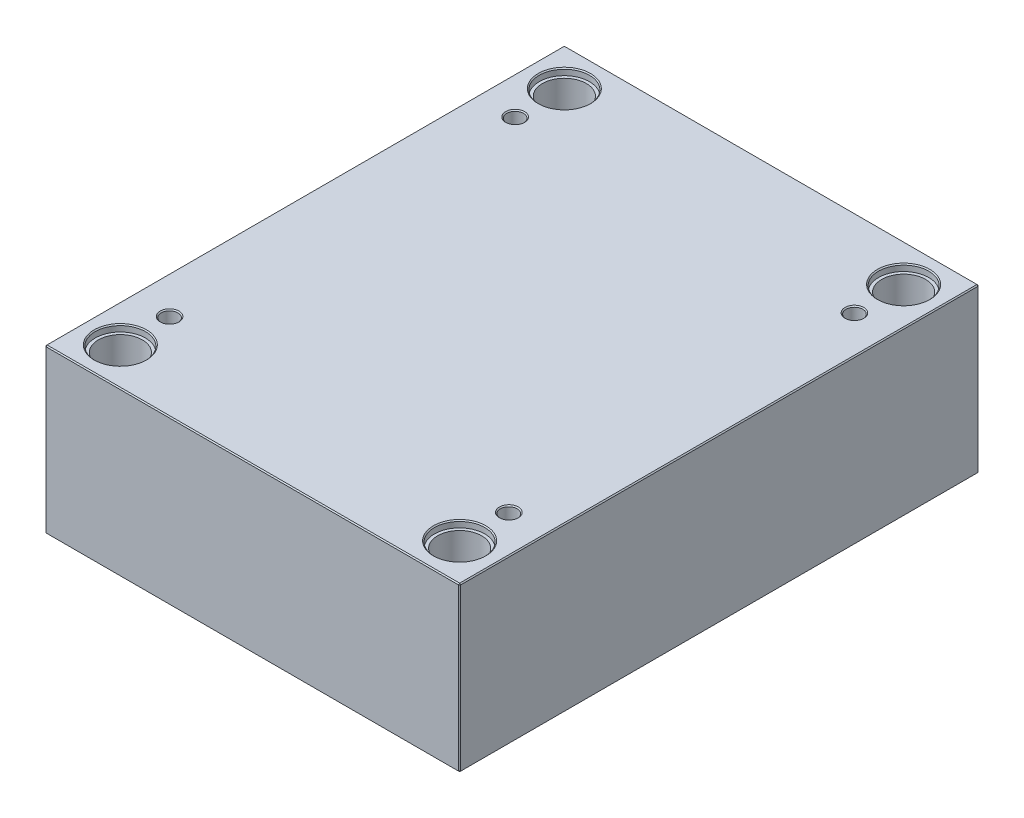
ISO-10303-21;
HEADER;
FILE_DESCRIPTION(('STEP AP214'),'2;1');
FILE_NAME('part.step','',(''),(''),'','','');
FILE_SCHEMA(('AUTOMOTIVE_DESIGN { 1 0 10303 214 1 1 1 1 }'));
ENDSEC;
DATA;
#1=APPLICATION_CONTEXT('core data for automotive mechanical design processes');
#2=APPLICATION_PROTOCOL_DEFINITION('international standard','automotive_design',2000,#1);
#3=PRODUCT_CONTEXT('',#1,'mechanical');
#4=PRODUCT('Part','Part','',(#3));
#5=PRODUCT_RELATED_PRODUCT_CATEGORY('part','',(#4));
#6=PRODUCT_DEFINITION_FORMATION('','',#4);
#7=PRODUCT_DEFINITION_CONTEXT('part definition',#1,'design');
#8=PRODUCT_DEFINITION('design','',#6,#7);
#9=PRODUCT_DEFINITION_SHAPE('','',#8);
#10=(LENGTH_UNIT() NAMED_UNIT(*) SI_UNIT(.MILLI.,.METRE.));
#11=(NAMED_UNIT(*) PLANE_ANGLE_UNIT() SI_UNIT($,.RADIAN.));
#12=(NAMED_UNIT(*) SI_UNIT($,.STERADIAN.) SOLID_ANGLE_UNIT());
#13=UNCERTAINTY_MEASURE_WITH_UNIT(LENGTH_MEASURE(1.E-05),#10,'distance_accuracy_value','');
#14=(GEOMETRIC_REPRESENTATION_CONTEXT(3) GLOBAL_UNCERTAINTY_ASSIGNED_CONTEXT((#13)) GLOBAL_UNIT_ASSIGNED_CONTEXT((#10,
#11,#12)) REPRESENTATION_CONTEXT('',''));
#15=CARTESIAN_POINT('',(0.,0.,0.));
#16=DIRECTION('',(0.,0.,1.));
#17=DIRECTION('',(1.,0.,0.));
#18=AXIS2_PLACEMENT_3D('',#15,#16,#17);
#19=CARTESIAN_POINT('',(-162.,0.,-212.));
#20=DIRECTION('',(0.,1.,0.));
#21=DIRECTION('',(0.,0.,1.));
#22=AXIS2_PLACEMENT_3D('',#19,#20,#21);
#23=CYLINDRICAL_SURFACE('',#22,21.);
#24=CARTESIAN_POINT('',(-162.,1.00000000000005,-212.));
#25=DIRECTION('',(0.,1.,0.));
#26=DIRECTION('',(0.,0.,1.));
#27=AXIS2_PLACEMENT_3D('',#24,#25,#26);
#28=CIRCLE('',#27,21.);
#29=CARTESIAN_POINT('',(-162.,1.00000000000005,-191.));
#30=VERTEX_POINT('',#29);
#31=EDGE_CURVE('E472',#30,#30,#28,.F.);
#32=ORIENTED_EDGE('',*,*,#31,.T.);
#33=EDGE_LOOP('',(#32));
#34=FACE_BOUND('',#33,.T.);
#35=CARTESIAN_POINT('',(-162.,149.7,-212.));
#36=DIRECTION('',(0.,1.,0.));
#37=DIRECTION('',(0.,0.,1.));
#38=AXIS2_PLACEMENT_3D('',#35,#36,#37);
#39=CIRCLE('',#38,21.);
#40=CARTESIAN_POINT('',(-162.,149.7,-191.));
#41=VERTEX_POINT('',#40);
#42=EDGE_CURVE('E221',#41,#41,#39,.F.);
#43=ORIENTED_EDGE('',*,*,#42,.F.);
#44=EDGE_LOOP('',(#43));
#45=FACE_BOUND('',#44,.T.);
#46=ADVANCED_FACE('F16',(#34,#45),#23,.F.);
#47=CARTESIAN_POINT('',(162.,0.,-212.));
#48=DIRECTION('',(0.,1.,0.));
#49=DIRECTION('',(0.,0.,1.));
#50=AXIS2_PLACEMENT_3D('',#47,#48,#49);
#51=CYLINDRICAL_SURFACE('',#50,21.);
#52=CARTESIAN_POINT('',(162.,1.00000000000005,-212.));
#53=DIRECTION('',(0.,1.,0.));
#54=DIRECTION('',(0.,0.,1.));
#55=AXIS2_PLACEMENT_3D('',#52,#53,#54);
#56=CIRCLE('',#55,21.);
#57=CARTESIAN_POINT('',(162.,1.00000000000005,-191.));
#58=VERTEX_POINT('',#57);
#59=EDGE_CURVE('E474',#58,#58,#56,.F.);
#60=ORIENTED_EDGE('',*,*,#59,.T.);
#61=EDGE_LOOP('',(#60));
#62=FACE_BOUND('',#61,.T.);
#63=CARTESIAN_POINT('',(162.,149.7,-212.));
#64=DIRECTION('',(0.,1.,0.));
#65=DIRECTION('',(0.,0.,1.));
#66=AXIS2_PLACEMENT_3D('',#63,#64,#65);
#67=CIRCLE('',#66,21.);
#68=CARTESIAN_POINT('',(162.,149.7,-191.));
#69=VERTEX_POINT('',#68);
#70=EDGE_CURVE('E218',#69,#69,#67,.F.);
#71=ORIENTED_EDGE('',*,*,#70,.F.);
#72=EDGE_LOOP('',(#71));
#73=FACE_BOUND('',#72,.T.);
#74=ADVANCED_FACE('F263',(#62,#73),#51,.F.);
#75=CARTESIAN_POINT('',(162.,0.,212.));
#76=DIRECTION('',(0.,1.,0.));
#77=DIRECTION('',(0.,0.,1.));
#78=AXIS2_PLACEMENT_3D('',#75,#76,#77);
#79=CYLINDRICAL_SURFACE('',#78,21.);
#80=CARTESIAN_POINT('',(162.,1.00000000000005,212.));
#81=DIRECTION('',(0.,1.,0.));
#82=DIRECTION('',(0.,0.,1.));
#83=AXIS2_PLACEMENT_3D('',#80,#81,#82);
#84=CIRCLE('',#83,21.);
#85=CARTESIAN_POINT('',(162.,1.00000000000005,233.));
#86=VERTEX_POINT('',#85);
#87=EDGE_CURVE('E477',#86,#86,#84,.F.);
#88=ORIENTED_EDGE('',*,*,#87,.T.);
#89=EDGE_LOOP('',(#88));
#90=FACE_BOUND('',#89,.T.);
#91=CARTESIAN_POINT('',(162.,149.7,212.));
#92=DIRECTION('',(0.,1.,0.));
#93=DIRECTION('',(0.,0.,1.));
#94=AXIS2_PLACEMENT_3D('',#91,#92,#93);
#95=CIRCLE('',#94,21.);
#96=CARTESIAN_POINT('',(162.,149.7,233.));
#97=VERTEX_POINT('',#96);
#98=EDGE_CURVE('E214',#97,#97,#95,.F.);
#99=ORIENTED_EDGE('',*,*,#98,.F.);
#100=EDGE_LOOP('',(#99));
#101=FACE_BOUND('',#100,.T.);
#102=ADVANCED_FACE('F270',(#90,#101),#79,.F.);
#103=CARTESIAN_POINT('',(-162.,0.,212.));
#104=DIRECTION('',(0.,1.,0.));
#105=DIRECTION('',(0.,0.,1.));
#106=AXIS2_PLACEMENT_3D('',#103,#104,#105);
#107=CYLINDRICAL_SURFACE('',#106,21.);
#108=CARTESIAN_POINT('',(-162.,1.00000000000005,212.));
#109=DIRECTION('',(0.,1.,0.));
#110=DIRECTION('',(0.,0.,1.));
#111=AXIS2_PLACEMENT_3D('',#108,#109,#110);
#112=CIRCLE('',#111,21.);
#113=CARTESIAN_POINT('',(-162.,1.00000000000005,233.));
#114=VERTEX_POINT('',#113);
#115=EDGE_CURVE('E480',#114,#114,#112,.F.);
#116=ORIENTED_EDGE('',*,*,#115,.T.);
#117=EDGE_LOOP('',(#116));
#118=FACE_BOUND('',#117,.T.);
#119=CARTESIAN_POINT('',(-162.,149.7,212.));
#120=DIRECTION('',(0.,1.,0.));
#121=DIRECTION('',(0.,0.,1.));
#122=AXIS2_PLACEMENT_3D('',#119,#120,#121);
#123=CIRCLE('',#122,21.);
#124=CARTESIAN_POINT('',(-162.,149.7,233.));
#125=VERTEX_POINT('',#124);
#126=EDGE_CURVE('E211',#125,#125,#123,.F.);
#127=ORIENTED_EDGE('',*,*,#126,.F.);
#128=EDGE_LOOP('',(#127));
#129=FACE_BOUND('',#128,.T.);
#130=ADVANCED_FACE('F277',(#118,#129),#107,.F.);
#131=CARTESIAN_POINT('',(-198.,156.,248.));
#132=DIRECTION('',(1.,0.,0.));
#133=DIRECTION('',(0.,0.,-1.));
#134=AXIS2_PLACEMENT_3D('',#131,#132,#133);
#135=PLANE('',#134);
#136=DIRECTION('',(0.,-1.,0.));
#137=VECTOR('',#136,1.);
#138=CARTESIAN_POINT('',(-198.,156.,-247.));
#139=LINE('',#138,#137);
#140=CARTESIAN_POINT('',(-198.,155.,-247.));
#141=VERTEX_POINT('',#140);
#142=CARTESIAN_POINT('',(-198.,1.,-247.));
#143=VERTEX_POINT('',#142);
#144=EDGE_CURVE('E487',#141,#143,#139,.T.);
#145=ORIENTED_EDGE('',*,*,#144,.T.);
#146=DIRECTION('',(0.,0.,1.));
#147=VECTOR('',#146,1.);
#148=CARTESIAN_POINT('',(-198.,1.,248.));
#149=LINE('',#148,#147);
#150=CARTESIAN_POINT('',(-198.,1.,247.));
#151=VERTEX_POINT('',#150);
#152=EDGE_CURVE('E490',#143,#151,#149,.T.);
#153=ORIENTED_EDGE('',*,*,#152,.T.);
#154=DIRECTION('',(0.,1.,0.));
#155=VECTOR('',#154,1.);
#156=CARTESIAN_POINT('',(-198.,156.,247.));
#157=LINE('',#156,#155);
#158=CARTESIAN_POINT('',(-198.,155.,247.));
#159=VERTEX_POINT('',#158);
#160=EDGE_CURVE('E485',#151,#159,#157,.T.);
#161=ORIENTED_EDGE('',*,*,#160,.T.);
#162=DIRECTION('',(0.,0.,-1.));
#163=VECTOR('',#162,1.);
#164=CARTESIAN_POINT('',(-198.,155.,-248.));
#165=LINE('',#164,#163);
#166=EDGE_CURVE('E483',#159,#141,#165,.T.);
#167=ORIENTED_EDGE('',*,*,#166,.T.);
#168=EDGE_LOOP('',(#145,#153,#161,#167));
#169=FACE_BOUND('',#168,.T.);
#170=ADVANCED_FACE('F298',(#169),#135,.F.);
#171=CARTESIAN_POINT('',(198.,156.,248.));
#172=DIRECTION('',(0.,0.,-1.));
#173=DIRECTION('',(-1.,0.,0.));
#174=AXIS2_PLACEMENT_3D('',#171,#172,#173);
#175=PLANE('',#174);
#176=DIRECTION('',(-1.,0.,0.));
#177=VECTOR('',#176,1.);
#178=CARTESIAN_POINT('',(-198.,155.,248.));
#179=LINE('',#178,#177);
#180=CARTESIAN_POINT('',(197.,155.,248.));
#181=VERTEX_POINT('',#180);
#182=CARTESIAN_POINT('',(-197.,155.,248.));
#183=VERTEX_POINT('',#182);
#184=EDGE_CURVE('E509',#181,#183,#179,.T.);
#185=ORIENTED_EDGE('',*,*,#184,.T.);
#186=DIRECTION('',(0.,-1.,0.));
#187=VECTOR('',#186,1.);
#188=CARTESIAN_POINT('',(-197.,156.,248.));
#189=LINE('',#188,#187);
#190=CARTESIAN_POINT('',(-197.,1.,248.));
#191=VERTEX_POINT('',#190);
#192=EDGE_CURVE('E515',#183,#191,#189,.T.);
#193=ORIENTED_EDGE('',*,*,#192,.T.);
#194=DIRECTION('',(1.,0.,0.));
#195=VECTOR('',#194,1.);
#196=CARTESIAN_POINT('',(198.,1.,248.));
#197=LINE('',#196,#195);
#198=CARTESIAN_POINT('',(197.,1.,248.));
#199=VERTEX_POINT('',#198);
#200=EDGE_CURVE('E513',#191,#199,#197,.T.);
#201=ORIENTED_EDGE('',*,*,#200,.T.);
#202=DIRECTION('',(0.,1.,0.));
#203=VECTOR('',#202,1.);
#204=CARTESIAN_POINT('',(197.,156.,248.));
#205=LINE('',#204,#203);
#206=EDGE_CURVE('E511',#199,#181,#205,.T.);
#207=ORIENTED_EDGE('',*,*,#206,.T.);
#208=EDGE_LOOP('',(#185,#193,#201,#207));
#209=FACE_BOUND('',#208,.T.);
#210=ADVANCED_FACE('F294',(#209),#175,.F.);
#211=CARTESIAN_POINT('',(198.,156.,248.));
#212=DIRECTION('',(-1.,0.,0.));
#213=DIRECTION('',(0.,0.,1.));
#214=AXIS2_PLACEMENT_3D('',#211,#212,#213);
#215=PLANE('',#214);
#216=DIRECTION('',(0.,0.,-1.));
#217=VECTOR('',#216,1.);
#218=CARTESIAN_POINT('',(198.,1.,248.));
#219=LINE('',#218,#217);
#220=CARTESIAN_POINT('',(198.,1.,247.));
#221=VERTEX_POINT('',#220);
#222=CARTESIAN_POINT('',(198.,1.,-247.));
#223=VERTEX_POINT('',#222);
#224=EDGE_CURVE('E504',#221,#223,#219,.T.);
#225=ORIENTED_EDGE('',*,*,#224,.T.);
#226=DIRECTION('',(0.,1.,0.));
#227=VECTOR('',#226,1.);
#228=CARTESIAN_POINT('',(198.,156.,-247.));
#229=LINE('',#228,#227);
#230=CARTESIAN_POINT('',(198.,155.,-247.));
#231=VERTEX_POINT('',#230);
#232=EDGE_CURVE('E506',#223,#231,#229,.T.);
#233=ORIENTED_EDGE('',*,*,#232,.T.);
#234=DIRECTION('',(0.,0.,1.));
#235=VECTOR('',#234,1.);
#236=CARTESIAN_POINT('',(198.,155.,248.));
#237=LINE('',#236,#235);
#238=CARTESIAN_POINT('',(198.,155.,247.));
#239=VERTEX_POINT('',#238);
#240=EDGE_CURVE('E500',#231,#239,#237,.T.);
#241=ORIENTED_EDGE('',*,*,#240,.T.);
#242=DIRECTION('',(0.,-1.,0.));
#243=VECTOR('',#242,1.);
#244=CARTESIAN_POINT('',(198.,156.,247.));
#245=LINE('',#244,#243);
#246=EDGE_CURVE('E502',#239,#221,#245,.T.);
#247=ORIENTED_EDGE('',*,*,#246,.T.);
#248=EDGE_LOOP('',(#225,#233,#241,#247));
#249=FACE_BOUND('',#248,.T.);
#250=ADVANCED_FACE('F290',(#249),#215,.F.);
#251=CARTESIAN_POINT('',(198.,156.,-248.));
#252=DIRECTION('',(0.,0.,1.));
#253=DIRECTION('',(1.,0.,0.));
#254=AXIS2_PLACEMENT_3D('',#251,#252,#253);
#255=PLANE('',#254);
#256=DIRECTION('',(0.,-1.,0.));
#257=VECTOR('',#256,1.);
#258=CARTESIAN_POINT('',(197.,156.,-248.));
#259=LINE('',#258,#257);
#260=CARTESIAN_POINT('',(197.,155.,-248.));
#261=VERTEX_POINT('',#260);
#262=CARTESIAN_POINT('',(197.,1.,-248.));
#263=VERTEX_POINT('',#262);
#264=EDGE_CURVE('E494',#261,#263,#259,.T.);
#265=ORIENTED_EDGE('',*,*,#264,.T.);
#266=DIRECTION('',(-1.,0.,0.));
#267=VECTOR('',#266,1.);
#268=CARTESIAN_POINT('',(198.,1.,-248.));
#269=LINE('',#268,#267);
#270=CARTESIAN_POINT('',(-197.,1.,-248.));
#271=VERTEX_POINT('',#270);
#272=EDGE_CURVE('E138',#263,#271,#269,.T.);
#273=ORIENTED_EDGE('',*,*,#272,.T.);
#274=DIRECTION('',(0.,1.,0.));
#275=VECTOR('',#274,1.);
#276=CARTESIAN_POINT('',(-197.,156.,-248.));
#277=LINE('',#276,#275);
#278=CARTESIAN_POINT('',(-197.,155.,-248.));
#279=VERTEX_POINT('',#278);
#280=EDGE_CURVE('E496',#271,#279,#277,.T.);
#281=ORIENTED_EDGE('',*,*,#280,.T.);
#282=DIRECTION('',(1.,0.,0.));
#283=VECTOR('',#282,1.);
#284=CARTESIAN_POINT('',(198.,155.,-248.));
#285=LINE('',#284,#283);
#286=EDGE_CURVE('E492',#279,#261,#285,.T.);
#287=ORIENTED_EDGE('',*,*,#286,.T.);
#288=EDGE_LOOP('',(#265,#273,#281,#287));
#289=FACE_BOUND('',#288,.T.);
#290=ADVANCED_FACE('F282',(#289),#255,.F.);
#291=CARTESIAN_POINT('',(0.,156.,0.));
#292=DIRECTION('',(0.,1.,0.));
#293=DIRECTION('',(0.,0.,1.));
#294=AXIS2_PLACEMENT_3D('',#291,#292,#293);
#295=PLANE('',#294);
#296=CARTESIAN_POINT('',(162.,156.,212.));
#297=DIRECTION('',(0.,1.,0.));
#298=DIRECTION('',(0.,0.,1.));
#299=AXIS2_PLACEMENT_3D('',#296,#297,#298);
#300=CIRCLE('',#299,25.);
#301=CARTESIAN_POINT('',(162.,156.,237.));
#302=VERTEX_POINT('',#301);
#303=EDGE_CURVE('E236',#302,#302,#300,.F.);
#304=ORIENTED_EDGE('',*,*,#303,.T.);
#305=EDGE_LOOP('',(#304));
#306=FACE_BOUND('',#305,.T.);
#307=CARTESIAN_POINT('',(-162.,156.,212.));
#308=DIRECTION('',(0.,1.,0.));
#309=DIRECTION('',(0.,0.,1.));
#310=AXIS2_PLACEMENT_3D('',#307,#308,#309);
#311=CIRCLE('',#310,25.);
#312=CARTESIAN_POINT('',(-162.,156.,237.));
#313=VERTEX_POINT('',#312);
#314=EDGE_CURVE('E233',#313,#313,#311,.F.);
#315=ORIENTED_EDGE('',*,*,#314,.T.);
#316=EDGE_LOOP('',(#315));
#317=FACE_BOUND('',#316,.T.);
#318=CARTESIAN_POINT('',(162.,156.,-212.));
#319=DIRECTION('',(0.,1.,0.));
#320=DIRECTION('',(0.,0.,1.));
#321=AXIS2_PLACEMENT_3D('',#318,#319,#320);
#322=CIRCLE('',#321,25.);
#323=CARTESIAN_POINT('',(162.,156.,-187.));
#324=VERTEX_POINT('',#323);
#325=EDGE_CURVE('E230',#324,#324,#322,.F.);
#326=ORIENTED_EDGE('',*,*,#325,.T.);
#327=EDGE_LOOP('',(#326));
#328=FACE_BOUND('',#327,.T.);
#329=CARTESIAN_POINT('',(-162.,156.,-212.));
#330=DIRECTION('',(0.,1.,0.));
#331=DIRECTION('',(0.,0.,1.));
#332=AXIS2_PLACEMENT_3D('',#329,#330,#331);
#333=CIRCLE('',#332,25.);
#334=CARTESIAN_POINT('',(-162.,156.,-187.));
#335=VERTEX_POINT('',#334);
#336=EDGE_CURVE('E227',#335,#335,#333,.F.);
#337=ORIENTED_EDGE('',*,*,#336,.T.);
#338=EDGE_LOOP('',(#337));
#339=FACE_BOUND('',#338,.T.);
#340=CARTESIAN_POINT('',(-162.,156.,165.));
#341=DIRECTION('',(0.,1.,0.));
#342=DIRECTION('',(0.,0.,1.));
#343=AXIS2_PLACEMENT_3D('',#340,#341,#342);
#344=CIRCLE('',#343,8.9999999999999);
#345=CARTESIAN_POINT('',(-162.,156.,174.));
#346=VERTEX_POINT('',#345);
#347=EDGE_CURVE('E198',#346,#346,#344,.F.);
#348=ORIENTED_EDGE('',*,*,#347,.T.);
#349=EDGE_LOOP('',(#348));
#350=FACE_BOUND('',#349,.T.);
#351=CARTESIAN_POINT('',(162.,156.,165.));
#352=DIRECTION('',(0.,1.,0.));
#353=DIRECTION('',(0.,0.,1.));
#354=AXIS2_PLACEMENT_3D('',#351,#352,#353);
#355=CIRCLE('',#354,8.9999999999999);
#356=CARTESIAN_POINT('',(162.,156.,174.));
#357=VERTEX_POINT('',#356);
#358=EDGE_CURVE('E195',#357,#357,#355,.F.);
#359=ORIENTED_EDGE('',*,*,#358,.T.);
#360=EDGE_LOOP('',(#359));
#361=FACE_BOUND('',#360,.T.);
#362=CARTESIAN_POINT('',(162.,156.,-165.));
#363=DIRECTION('',(0.,1.,0.));
#364=DIRECTION('',(0.,0.,1.));
#365=AXIS2_PLACEMENT_3D('',#362,#363,#364);
#366=CIRCLE('',#365,9.);
#367=CARTESIAN_POINT('',(162.,156.,-156.));
#368=VERTEX_POINT('',#367);
#369=EDGE_CURVE('E192',#368,#368,#366,.F.);
#370=ORIENTED_EDGE('',*,*,#369,.T.);
#371=EDGE_LOOP('',(#370));
#372=FACE_BOUND('',#371,.T.);
#373=CARTESIAN_POINT('',(-162.,156.,-165.));
#374=DIRECTION('',(0.,1.,0.));
#375=DIRECTION('',(0.,0.,1.));
#376=AXIS2_PLACEMENT_3D('',#373,#374,#375);
#377=CIRCLE('',#376,8.9999999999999);
#378=CARTESIAN_POINT('',(-162.,156.,-156.));
#379=VERTEX_POINT('',#378);
#380=EDGE_CURVE('E188',#379,#379,#377,.F.);
#381=ORIENTED_EDGE('',*,*,#380,.T.);
#382=EDGE_LOOP('',(#381));
#383=FACE_BOUND('',#382,.T.);
#384=DIRECTION('',(0.,0.,-1.));
#385=VECTOR('',#384,1.);
#386=CARTESIAN_POINT('',(197.,156.,-248.));
#387=LINE('',#386,#385);
#388=CARTESIAN_POINT('',(197.,156.,247.));
#389=VERTEX_POINT('',#388);
#390=CARTESIAN_POINT('',(197.,156.,-247.));
#391=VERTEX_POINT('',#390);
#392=EDGE_CURVE('E31',#389,#391,#387,.T.);
#393=ORIENTED_EDGE('',*,*,#392,.T.);
#394=DIRECTION('',(-1.,0.,0.));
#395=VECTOR('',#394,1.);
#396=CARTESIAN_POINT('',(-198.,156.,-247.));
#397=LINE('',#396,#395);
#398=CARTESIAN_POINT('',(-197.,156.,-247.));
#399=VERTEX_POINT('',#398);
#400=EDGE_CURVE('E189',#391,#399,#397,.T.);
#401=ORIENTED_EDGE('',*,*,#400,.T.);
#402=DIRECTION('',(0.,0.,1.));
#403=VECTOR('',#402,1.);
#404=CARTESIAN_POINT('',(-197.,156.,248.));
#405=LINE('',#404,#403);
#406=CARTESIAN_POINT('',(-197.,156.,247.));
#407=VERTEX_POINT('',#406);
#408=EDGE_CURVE('E518',#399,#407,#405,.T.);
#409=ORIENTED_EDGE('',*,*,#408,.T.);
#410=DIRECTION('',(1.,0.,0.));
#411=VECTOR('',#410,1.);
#412=CARTESIAN_POINT('',(198.,156.,247.));
#413=LINE('',#412,#411);
#414=EDGE_CURVE('E36',#407,#389,#413,.T.);
#415=ORIENTED_EDGE('',*,*,#414,.T.);
#416=EDGE_LOOP('',(#393,#401,#409,#415));
#417=FACE_BOUND('',#416,.T.);
#418=ADVANCED_FACE('F279',(#306,#317,#328,#339,#350,#361,#372,#383,#417),#295,.T.);
#419=CARTESIAN_POINT('',(0.,0.,0.));
#420=DIRECTION('',(0.,1.,0.));
#421=DIRECTION('',(0.,0.,1.));
#422=AXIS2_PLACEMENT_3D('',#419,#420,#421);
#423=PLANE('',#422);
#424=CARTESIAN_POINT('',(-162.,0.,-212.));
#425=DIRECTION('',(0.,1.,0.));
#426=DIRECTION('',(0.,0.,1.));
#427=AXIS2_PLACEMENT_3D('',#424,#425,#426);
#428=CIRCLE('',#427,22.);
#429=CARTESIAN_POINT('',(-162.,0.,-190.));
#430=VERTEX_POINT('',#429);
#431=EDGE_CURVE('E469',#430,#430,#428,.T.);
#432=ORIENTED_EDGE('',*,*,#431,.T.);
#433=EDGE_LOOP('',(#432));
#434=FACE_BOUND('',#433,.T.);
#435=CARTESIAN_POINT('',(162.,0.,-212.));
#436=DIRECTION('',(0.,1.,0.));
#437=DIRECTION('',(0.,0.,1.));
#438=AXIS2_PLACEMENT_3D('',#435,#436,#437);
#439=CIRCLE('',#438,22.);
#440=CARTESIAN_POINT('',(162.,0.,-190.));
#441=VERTEX_POINT('',#440);
#442=EDGE_CURVE('E466',#441,#441,#439,.T.);
#443=ORIENTED_EDGE('',*,*,#442,.T.);
#444=EDGE_LOOP('',(#443));
#445=FACE_BOUND('',#444,.T.);
#446=CARTESIAN_POINT('',(162.,0.,212.));
#447=DIRECTION('',(0.,1.,0.));
#448=DIRECTION('',(0.,0.,1.));
#449=AXIS2_PLACEMENT_3D('',#446,#447,#448);
#450=CIRCLE('',#449,22.);
#451=CARTESIAN_POINT('',(162.,0.,234.));
#452=VERTEX_POINT('',#451);
#453=EDGE_CURVE('E463',#452,#452,#450,.T.);
#454=ORIENTED_EDGE('',*,*,#453,.T.);
#455=EDGE_LOOP('',(#454));
#456=FACE_BOUND('',#455,.T.);
#457=CARTESIAN_POINT('',(-162.,0.,212.));
#458=DIRECTION('',(0.,1.,0.));
#459=DIRECTION('',(0.,0.,1.));
#460=AXIS2_PLACEMENT_3D('',#457,#458,#459);
#461=CIRCLE('',#460,22.);
#462=CARTESIAN_POINT('',(-162.,0.,234.));
#463=VERTEX_POINT('',#462);
#464=EDGE_CURVE('E460',#463,#463,#461,.T.);
#465=ORIENTED_EDGE('',*,*,#464,.T.);
#466=EDGE_LOOP('',(#465));
#467=FACE_BOUND('',#466,.T.);
#468=DIRECTION('',(0.,0.,1.));
#469=VECTOR('',#468,1.);
#470=CARTESIAN_POINT('',(197.,0.,0.));
#471=LINE('',#470,#469);
#472=CARTESIAN_POINT('',(197.,0.,-247.));
#473=VERTEX_POINT('',#472);
#474=CARTESIAN_POINT('',(197.,0.,247.));
#475=VERTEX_POINT('',#474);
#476=EDGE_CURVE('E108',#473,#475,#471,.T.);
#477=ORIENTED_EDGE('',*,*,#476,.T.);
#478=DIRECTION('',(-1.,0.,0.));
#479=VECTOR('',#478,1.);
#480=CARTESIAN_POINT('',(0.,0.,247.));
#481=LINE('',#480,#479);
#482=CARTESIAN_POINT('',(-197.,0.,247.));
#483=VERTEX_POINT('',#482);
#484=EDGE_CURVE('E458',#475,#483,#481,.T.);
#485=ORIENTED_EDGE('',*,*,#484,.T.);
#486=DIRECTION('',(0.,0.,-1.));
#487=VECTOR('',#486,1.);
#488=CARTESIAN_POINT('',(-197.,0.,0.));
#489=LINE('',#488,#487);
#490=CARTESIAN_POINT('',(-197.,0.,-247.));
#491=VERTEX_POINT('',#490);
#492=EDGE_CURVE('E110',#483,#491,#489,.T.);
#493=ORIENTED_EDGE('',*,*,#492,.T.);
#494=DIRECTION('',(1.,0.,0.));
#495=VECTOR('',#494,1.);
#496=CARTESIAN_POINT('',(0.,0.,-247.));
#497=LINE('',#496,#495);
#498=EDGE_CURVE('E104',#491,#473,#497,.T.);
#499=ORIENTED_EDGE('',*,*,#498,.T.);
#500=EDGE_LOOP('',(#477,#485,#493,#499));
#501=FACE_BOUND('',#500,.T.);
#502=ADVANCED_FACE('F106',(#434,#445,#456,#467,#501),#423,.F.);
#503=CARTESIAN_POINT('',(-162.,0.,-212.));
#504=DIRECTION('',(0.,-1.,0.));
#505=DIRECTION('',(0.,0.,-1.));
#506=AXIS2_PLACEMENT_3D('',#503,#504,#505);
#507=CONICAL_SURFACE('',#506,22.,0.785398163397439);
#508=ORIENTED_EDGE('',*,*,#31,.F.);
#509=EDGE_LOOP('',(#508));
#510=FACE_BOUND('',#509,.T.);
#511=ORIENTED_EDGE('',*,*,#431,.F.);
#512=EDGE_LOOP('',(#511));
#513=FACE_BOUND('',#512,.T.);
#514=ADVANCED_FACE('F286',(#510,#513),#507,.F.);
#515=CARTESIAN_POINT('',(162.,0.,-212.));
#516=DIRECTION('',(0.,-1.,0.));
#517=DIRECTION('',(0.,0.,-1.));
#518=AXIS2_PLACEMENT_3D('',#515,#516,#517);
#519=CONICAL_SURFACE('',#518,22.,0.785398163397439);
#520=ORIENTED_EDGE('',*,*,#59,.F.);
#521=EDGE_LOOP('',(#520));
#522=FACE_BOUND('',#521,.T.);
#523=ORIENTED_EDGE('',*,*,#442,.F.);
#524=EDGE_LOOP('',(#523));
#525=FACE_BOUND('',#524,.T.);
#526=ADVANCED_FACE('F305',(#522,#525),#519,.F.);
#527=CARTESIAN_POINT('',(162.,0.,212.));
#528=DIRECTION('',(0.,-1.,0.));
#529=DIRECTION('',(0.,0.,-1.));
#530=AXIS2_PLACEMENT_3D('',#527,#528,#529);
#531=CONICAL_SURFACE('',#530,22.,0.785398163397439);
#532=ORIENTED_EDGE('',*,*,#87,.F.);
#533=EDGE_LOOP('',(#532));
#534=FACE_BOUND('',#533,.T.);
#535=ORIENTED_EDGE('',*,*,#453,.F.);
#536=EDGE_LOOP('',(#535));
#537=FACE_BOUND('',#536,.T.);
#538=ADVANCED_FACE('F309',(#534,#537),#531,.F.);
#539=CARTESIAN_POINT('',(-162.,0.,212.));
#540=DIRECTION('',(0.,-1.,0.));
#541=DIRECTION('',(0.,0.,-1.));
#542=AXIS2_PLACEMENT_3D('',#539,#540,#541);
#543=CONICAL_SURFACE('',#542,22.,0.785398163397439);
#544=ORIENTED_EDGE('',*,*,#115,.F.);
#545=EDGE_LOOP('',(#544));
#546=FACE_BOUND('',#545,.T.);
#547=ORIENTED_EDGE('',*,*,#464,.F.);
#548=EDGE_LOOP('',(#547));
#549=FACE_BOUND('',#548,.T.);
#550=ADVANCED_FACE('F313',(#546,#549),#543,.F.);
#551=CARTESIAN_POINT('',(198.,156.,247.));
#552=DIRECTION('',(-0.707106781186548,0.,-0.707106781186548));
#553=DIRECTION('',(0.,-1.,0.));
#554=AXIS2_PLACEMENT_3D('',#551,#552,#553);
#555=PLANE('',#554);
#556=DIRECTION('',(-0.707106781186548,0.,0.707106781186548));
#557=VECTOR('',#556,1.);
#558=CARTESIAN_POINT('',(197.,155.,248.));
#559=LINE('',#558,#557);
#560=EDGE_CURVE('E126',#181,#239,#559,.F.);
#561=ORIENTED_EDGE('',*,*,#560,.F.);
#562=ORIENTED_EDGE('',*,*,#206,.F.);
#563=DIRECTION('',(0.707106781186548,0.,-0.707106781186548));
#564=VECTOR('',#563,1.);
#565=CARTESIAN_POINT('',(197.,1.,248.));
#566=LINE('',#565,#564);
#567=EDGE_CURVE('E180',#221,#199,#566,.F.);
#568=ORIENTED_EDGE('',*,*,#567,.F.);
#569=ORIENTED_EDGE('',*,*,#246,.F.);
#570=EDGE_LOOP('',(#561,#562,#568,#569));
#571=FACE_BOUND('',#570,.T.);
#572=ADVANCED_FACE('F317',(#571),#555,.F.);
#573=CARTESIAN_POINT('',(197.,155.,248.));
#574=DIRECTION('',(0.577350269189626,0.577350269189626,0.577350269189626));
#575=DIRECTION('',(0.707106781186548,0.,-0.707106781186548));
#576=AXIS2_PLACEMENT_3D('',#573,#574,#575);
#577=PLANE('',#576);
#578=DIRECTION('',(0.,-0.707106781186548,0.707106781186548));
#579=VECTOR('',#578,1.);
#580=CARTESIAN_POINT('',(197.,155.,248.));
#581=LINE('',#580,#579);
#582=EDGE_CURVE('E175',#181,#389,#581,.F.);
#583=ORIENTED_EDGE('',*,*,#582,.F.);
#584=ORIENTED_EDGE('',*,*,#560,.T.);
#585=DIRECTION('',(-0.707106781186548,0.707106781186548,0.));
#586=VECTOR('',#585,1.);
#587=CARTESIAN_POINT('',(197.5,155.5,247.));
#588=LINE('',#587,#586);
#589=EDGE_CURVE('E177',#389,#239,#588,.F.);
#590=ORIENTED_EDGE('',*,*,#589,.F.);
#591=EDGE_LOOP('',(#583,#584,#590));
#592=FACE_BOUND('',#591,.T.);
#593=ADVANCED_FACE('F385',(#592),#577,.T.);
#594=CARTESIAN_POINT('',(197.,1.,248.));
#595=DIRECTION('',(0.577350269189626,-0.577350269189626,0.577350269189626));
#596=DIRECTION('',(0.707106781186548,0.,-0.707106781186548));
#597=AXIS2_PLACEMENT_3D('',#594,#595,#596);
#598=PLANE('',#597);
#599=DIRECTION('',(-0.707106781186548,-0.707106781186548,0.));
#600=VECTOR('',#599,1.);
#601=CARTESIAN_POINT('',(197.5,0.5,247.));
#602=LINE('',#601,#600);
#603=EDGE_CURVE('E124',#221,#475,#602,.T.);
#604=ORIENTED_EDGE('',*,*,#603,.F.);
#605=ORIENTED_EDGE('',*,*,#567,.T.);
#606=DIRECTION('',(0.,0.707106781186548,0.707106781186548));
#607=VECTOR('',#606,1.);
#608=CARTESIAN_POINT('',(197.,1.,248.));
#609=LINE('',#608,#607);
#610=EDGE_CURVE('E172',#475,#199,#609,.T.);
#611=ORIENTED_EDGE('',*,*,#610,.F.);
#612=EDGE_LOOP('',(#604,#605,#611));
#613=FACE_BOUND('',#612,.T.);
#614=ADVANCED_FACE('F381',(#613),#598,.T.);
#615=CARTESIAN_POINT('',(197.,156.,0.));
#616=DIRECTION('',(0.707106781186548,0.707106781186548,0.));
#617=DIRECTION('',(0.,0.,1.));
#618=AXIS2_PLACEMENT_3D('',#615,#616,#617);
#619=PLANE('',#618);
#620=ORIENTED_EDGE('',*,*,#589,.T.);
#621=ORIENTED_EDGE('',*,*,#240,.F.);
#622=DIRECTION('',(0.707106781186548,-0.707106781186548,0.));
#623=VECTOR('',#622,1.);
#624=CARTESIAN_POINT('',(198.,155.,-247.));
#625=LINE('',#624,#623);
#626=EDGE_CURVE('E166',#391,#231,#625,.T.);
#627=ORIENTED_EDGE('',*,*,#626,.F.);
#628=ORIENTED_EDGE('',*,*,#392,.F.);
#629=EDGE_LOOP('',(#620,#621,#627,#628));
#630=FACE_BOUND('',#629,.T.);
#631=ADVANCED_FACE('F377',(#630),#619,.T.);
#632=CARTESIAN_POINT('',(0.,156.,247.));
#633=DIRECTION('',(0.,0.707106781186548,0.707106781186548));
#634=DIRECTION('',(-1.,0.,0.));
#635=AXIS2_PLACEMENT_3D('',#632,#633,#634);
#636=PLANE('',#635);
#637=ORIENTED_EDGE('',*,*,#582,.T.);
#638=ORIENTED_EDGE('',*,*,#414,.F.);
#639=DIRECTION('',(0.,0.707106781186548,-0.707106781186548));
#640=VECTOR('',#639,1.);
#641=CARTESIAN_POINT('',(-197.,155.5,247.5));
#642=LINE('',#641,#640);
#643=EDGE_CURVE('E163',#183,#407,#642,.T.);
#644=ORIENTED_EDGE('',*,*,#643,.F.);
#645=ORIENTED_EDGE('',*,*,#184,.F.);
#646=EDGE_LOOP('',(#637,#638,#644,#645));
#647=FACE_BOUND('',#646,.T.);
#648=ADVANCED_FACE('F373',(#647),#636,.T.);
#649=CARTESIAN_POINT('',(-197.,156.,248.));
#650=DIRECTION('',(0.707106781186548,0.,-0.707106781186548));
#651=DIRECTION('',(0.,-1.,0.));
#652=AXIS2_PLACEMENT_3D('',#649,#650,#651);
#653=PLANE('',#652);
#654=DIRECTION('',(0.707106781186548,0.,0.707106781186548));
#655=VECTOR('',#654,1.);
#656=CARTESIAN_POINT('',(-197.,1.,248.));
#657=LINE('',#656,#655);
#658=EDGE_CURVE('E157',#191,#151,#657,.F.);
#659=ORIENTED_EDGE('',*,*,#658,.F.);
#660=ORIENTED_EDGE('',*,*,#192,.F.);
#661=DIRECTION('',(-0.707106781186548,0.,-0.707106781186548));
#662=VECTOR('',#661,1.);
#663=CARTESIAN_POINT('',(-198.,155.,247.));
#664=LINE('',#663,#662);
#665=EDGE_CURVE('E160',#159,#183,#664,.F.);
#666=ORIENTED_EDGE('',*,*,#665,.F.);
#667=ORIENTED_EDGE('',*,*,#160,.F.);
#668=EDGE_LOOP('',(#659,#660,#666,#667));
#669=FACE_BOUND('',#668,.T.);
#670=ADVANCED_FACE('F369',(#669),#653,.F.);
#671=CARTESIAN_POINT('',(198.,1.,248.));
#672=DIRECTION('',(0.,0.707106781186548,-0.707106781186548));
#673=DIRECTION('',(1.,0.,0.));
#674=AXIS2_PLACEMENT_3D('',#671,#672,#673);
#675=PLANE('',#674);
#676=ORIENTED_EDGE('',*,*,#610,.T.);
#677=ORIENTED_EDGE('',*,*,#200,.F.);
#678=DIRECTION('',(0.,-0.707106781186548,-0.707106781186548));
#679=VECTOR('',#678,1.);
#680=CARTESIAN_POINT('',(-197.,1.,248.));
#681=LINE('',#680,#679);
#682=EDGE_CURVE('E135',#483,#191,#681,.F.);
#683=ORIENTED_EDGE('',*,*,#682,.F.);
#684=ORIENTED_EDGE('',*,*,#484,.F.);
#685=EDGE_LOOP('',(#676,#677,#683,#684));
#686=FACE_BOUND('',#685,.T.);
#687=ADVANCED_FACE('F366',(#686),#675,.F.);
#688=CARTESIAN_POINT('',(198.,1.,248.));
#689=DIRECTION('',(-0.707106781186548,0.707106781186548,0.));
#690=DIRECTION('',(0.,0.,-1.));
#691=AXIS2_PLACEMENT_3D('',#688,#689,#690);
#692=PLANE('',#691);
#693=ORIENTED_EDGE('',*,*,#603,.T.);
#694=ORIENTED_EDGE('',*,*,#476,.F.);
#695=DIRECTION('',(0.707106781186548,0.707106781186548,0.));
#696=VECTOR('',#695,1.);
#697=CARTESIAN_POINT('',(197.5,0.500000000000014,-247.));
#698=LINE('',#697,#696);
#699=EDGE_CURVE('E121',#223,#473,#698,.F.);
#700=ORIENTED_EDGE('',*,*,#699,.F.);
#701=ORIENTED_EDGE('',*,*,#224,.F.);
#702=EDGE_LOOP('',(#693,#694,#700,#701));
#703=FACE_BOUND('',#702,.T.);
#704=ADVANCED_FACE('F119',(#703),#692,.F.);
#705=CARTESIAN_POINT('',(197.,156.,-248.));
#706=DIRECTION('',(-0.707106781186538,0.,0.707106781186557));
#707=DIRECTION('',(0.,-1.,0.));
#708=AXIS2_PLACEMENT_3D('',#705,#706,#707);
#709=PLANE('',#708);
#710=DIRECTION('',(0.707106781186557,0.,0.707106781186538));
#711=VECTOR('',#710,1.);
#712=CARTESIAN_POINT('',(198.,155.,-247.));
#713=LINE('',#712,#711);
#714=EDGE_CURVE('E168',#231,#261,#713,.F.);
#715=ORIENTED_EDGE('',*,*,#714,.F.);
#716=ORIENTED_EDGE('',*,*,#232,.F.);
#717=DIRECTION('',(-0.707106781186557,0.,-0.707106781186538));
#718=VECTOR('',#717,1.);
#719=CARTESIAN_POINT('',(197.,1.,-248.));
#720=LINE('',#719,#718);
#721=EDGE_CURVE('E134',#263,#223,#720,.F.);
#722=ORIENTED_EDGE('',*,*,#721,.F.);
#723=ORIENTED_EDGE('',*,*,#264,.F.);
#724=EDGE_LOOP('',(#715,#716,#722,#723));
#725=FACE_BOUND('',#724,.T.);
#726=ADVANCED_FACE('F359',(#725),#709,.F.);
#727=CARTESIAN_POINT('',(198.,155.,-247.));
#728=DIRECTION('',(0.577350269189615,0.577350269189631,-0.577350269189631));
#729=DIRECTION('',(0.,0.707106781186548,0.707106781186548));
#730=AXIS2_PLACEMENT_3D('',#727,#728,#729);
#731=PLANE('',#730);
#732=ORIENTED_EDGE('',*,*,#626,.T.);
#733=ORIENTED_EDGE('',*,*,#714,.T.);
#734=DIRECTION('',(0.,0.707106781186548,0.707106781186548));
#735=VECTOR('',#734,1.);
#736=CARTESIAN_POINT('',(197.,155.5,-247.5));
#737=LINE('',#736,#735);
#738=EDGE_CURVE('E152',#391,#261,#737,.F.);
#739=ORIENTED_EDGE('',*,*,#738,.F.);
#740=EDGE_LOOP('',(#732,#733,#739));
#741=FACE_BOUND('',#740,.T.);
#742=ADVANCED_FACE('F355',(#741),#731,.T.);
#743=CARTESIAN_POINT('',(-198.,155.,247.));
#744=DIRECTION('',(-0.577350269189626,0.577350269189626,0.577350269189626));
#745=DIRECTION('',(0.707106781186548,0.,0.707106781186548));
#746=AXIS2_PLACEMENT_3D('',#743,#744,#745);
#747=PLANE('',#746);
#748=ORIENTED_EDGE('',*,*,#665,.T.);
#749=ORIENTED_EDGE('',*,*,#643,.T.);
#750=DIRECTION('',(-0.707106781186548,-0.707106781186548,0.));
#751=VECTOR('',#750,1.);
#752=CARTESIAN_POINT('',(-198.,155.,247.));
#753=LINE('',#752,#751);
#754=EDGE_CURVE('E143',#159,#407,#753,.F.);
#755=ORIENTED_EDGE('',*,*,#754,.F.);
#756=EDGE_LOOP('',(#748,#749,#755));
#757=FACE_BOUND('',#756,.T.);
#758=ADVANCED_FACE('F351',(#757),#747,.T.);
#759=CARTESIAN_POINT('',(-197.,1.,248.));
#760=DIRECTION('',(-0.577350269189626,-0.577350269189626,0.577350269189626));
#761=DIRECTION('',(0.707106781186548,0.,0.707106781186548));
#762=AXIS2_PLACEMENT_3D('',#759,#760,#761);
#763=PLANE('',#762);
#764=ORIENTED_EDGE('',*,*,#682,.T.);
#765=ORIENTED_EDGE('',*,*,#658,.T.);
#766=DIRECTION('',(-0.707106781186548,0.707106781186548,0.));
#767=VECTOR('',#766,1.);
#768=CARTESIAN_POINT('',(-197.5,0.5,247.));
#769=LINE('',#768,#767);
#770=EDGE_CURVE('E139',#483,#151,#769,.T.);
#771=ORIENTED_EDGE('',*,*,#770,.F.);
#772=EDGE_LOOP('',(#764,#765,#771));
#773=FACE_BOUND('',#772,.T.);
#774=ADVANCED_FACE('F348',(#773),#763,.T.);
#775=CARTESIAN_POINT('',(197.,1.,-248.));
#776=DIRECTION('',(0.577350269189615,-0.577350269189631,-0.577350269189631));
#777=DIRECTION('',(0.,0.707106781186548,-0.707106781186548));
#778=AXIS2_PLACEMENT_3D('',#775,#776,#777);
#779=PLANE('',#778);
#780=ORIENTED_EDGE('',*,*,#721,.T.);
#781=ORIENTED_EDGE('',*,*,#699,.T.);
#782=DIRECTION('',(0.,-0.707106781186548,0.707106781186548));
#783=VECTOR('',#782,1.);
#784=CARTESIAN_POINT('',(197.,1.,-248.));
#785=LINE('',#784,#783);
#786=EDGE_CURVE('E131',#263,#473,#785,.T.);
#787=ORIENTED_EDGE('',*,*,#786,.F.);
#788=EDGE_LOOP('',(#780,#781,#787));
#789=FACE_BOUND('',#788,.T.);
#790=ADVANCED_FACE('F130',(#789),#779,.T.);
#791=CARTESIAN_POINT('',(0.,156.,-247.));
#792=DIRECTION('',(0.,0.707106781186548,-0.707106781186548));
#793=DIRECTION('',(1.,0.,0.));
#794=AXIS2_PLACEMENT_3D('',#791,#792,#793);
#795=PLANE('',#794);
#796=ORIENTED_EDGE('',*,*,#738,.T.);
#797=ORIENTED_EDGE('',*,*,#286,.F.);
#798=DIRECTION('',(0.,-0.707106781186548,-0.707106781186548));
#799=VECTOR('',#798,1.);
#800=CARTESIAN_POINT('',(-197.,155.,-248.));
#801=LINE('',#800,#799);
#802=EDGE_CURVE('E140',#399,#279,#801,.T.);
#803=ORIENTED_EDGE('',*,*,#802,.F.);
#804=ORIENTED_EDGE('',*,*,#400,.F.);
#805=EDGE_LOOP('',(#796,#797,#803,#804));
#806=FACE_BOUND('',#805,.T.);
#807=ADVANCED_FACE('F341',(#806),#795,.T.);
#808=CARTESIAN_POINT('',(-197.,156.,0.));
#809=DIRECTION('',(-0.707106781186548,0.707106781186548,0.));
#810=DIRECTION('',(0.,0.,-1.));
#811=AXIS2_PLACEMENT_3D('',#808,#809,#810);
#812=PLANE('',#811);
#813=ORIENTED_EDGE('',*,*,#754,.T.);
#814=ORIENTED_EDGE('',*,*,#408,.F.);
#815=DIRECTION('',(0.707106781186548,0.707106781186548,0.));
#816=VECTOR('',#815,1.);
#817=CARTESIAN_POINT('',(-197.5,155.5,-247.));
#818=LINE('',#817,#816);
#819=EDGE_CURVE('E146',#141,#399,#818,.T.);
#820=ORIENTED_EDGE('',*,*,#819,.F.);
#821=ORIENTED_EDGE('',*,*,#166,.F.);
#822=EDGE_LOOP('',(#813,#814,#820,#821));
#823=FACE_BOUND('',#822,.T.);
#824=ADVANCED_FACE('F337',(#823),#812,.T.);
#825=CARTESIAN_POINT('',(-198.,1.,248.));
#826=DIRECTION('',(0.707106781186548,0.707106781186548,0.));
#827=DIRECTION('',(0.,0.,1.));
#828=AXIS2_PLACEMENT_3D('',#825,#826,#827);
#829=PLANE('',#828);
#830=ORIENTED_EDGE('',*,*,#770,.T.);
#831=ORIENTED_EDGE('',*,*,#152,.F.);
#832=DIRECTION('',(0.707106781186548,-0.707106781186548,0.));
#833=VECTOR('',#832,1.);
#834=CARTESIAN_POINT('',(-198.,1.,-247.));
#835=LINE('',#834,#833);
#836=EDGE_CURVE('E529',#491,#143,#835,.F.);
#837=ORIENTED_EDGE('',*,*,#836,.F.);
#838=ORIENTED_EDGE('',*,*,#492,.F.);
#839=EDGE_LOOP('',(#830,#831,#837,#838));
#840=FACE_BOUND('',#839,.T.);
#841=ADVANCED_FACE('F334',(#840),#829,.F.);
#842=CARTESIAN_POINT('',(198.,1.,-248.));
#843=DIRECTION('',(0.,0.707106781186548,0.707106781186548));
#844=DIRECTION('',(-1.,0.,0.));
#845=AXIS2_PLACEMENT_3D('',#842,#843,#844);
#846=PLANE('',#845);
#847=ORIENTED_EDGE('',*,*,#786,.T.);
#848=ORIENTED_EDGE('',*,*,#498,.F.);
#849=DIRECTION('',(0.,0.707106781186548,-0.707106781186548));
#850=VECTOR('',#849,1.);
#851=CARTESIAN_POINT('',(-197.,0.499999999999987,-247.5));
#852=LINE('',#851,#850);
#853=EDGE_CURVE('E526',#271,#491,#852,.F.);
#854=ORIENTED_EDGE('',*,*,#853,.F.);
#855=ORIENTED_EDGE('',*,*,#272,.F.);
#856=EDGE_LOOP('',(#847,#848,#854,#855));
#857=FACE_BOUND('',#856,.T.);
#858=ADVANCED_FACE('F137',(#857),#846,.F.);
#859=CARTESIAN_POINT('',(-197.,155.,-248.));
#860=DIRECTION('',(-0.577350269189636,0.57735026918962,-0.57735026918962));
#861=DIRECTION('',(-0.707106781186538,0.,0.707106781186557));
#862=AXIS2_PLACEMENT_3D('',#859,#860,#861);
#863=PLANE('',#862);
#864=ORIENTED_EDGE('',*,*,#819,.T.);
#865=ORIENTED_EDGE('',*,*,#802,.T.);
#866=DIRECTION('',(0.707106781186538,0.,-0.707106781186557));
#867=VECTOR('',#866,1.);
#868=CARTESIAN_POINT('',(-197.,155.,-248.));
#869=LINE('',#868,#867);
#870=EDGE_CURVE('E524',#141,#279,#869,.T.);
#871=ORIENTED_EDGE('',*,*,#870,.F.);
#872=EDGE_LOOP('',(#864,#865,#871));
#873=FACE_BOUND('',#872,.T.);
#874=ADVANCED_FACE('F327',(#873),#863,.T.);
#875=CARTESIAN_POINT('',(-198.,1.,-247.));
#876=DIRECTION('',(-0.577350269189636,-0.57735026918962,-0.57735026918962));
#877=DIRECTION('',(-0.707106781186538,0.,0.707106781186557));
#878=AXIS2_PLACEMENT_3D('',#875,#876,#877);
#879=PLANE('',#878);
#880=ORIENTED_EDGE('',*,*,#853,.T.);
#881=ORIENTED_EDGE('',*,*,#836,.T.);
#882=DIRECTION('',(-0.707106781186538,0.,0.707106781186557));
#883=VECTOR('',#882,1.);
#884=CARTESIAN_POINT('',(-198.,1.,-247.));
#885=LINE('',#884,#883);
#886=EDGE_CURVE('E455',#271,#143,#885,.T.);
#887=ORIENTED_EDGE('',*,*,#886,.F.);
#888=EDGE_LOOP('',(#880,#881,#887));
#889=FACE_BOUND('',#888,.T.);
#890=ADVANCED_FACE('F323',(#889),#879,.T.);
#891=CARTESIAN_POINT('',(-198.,156.,-247.));
#892=DIRECTION('',(0.707106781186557,0.,0.707106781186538));
#893=DIRECTION('',(0.,-1.,0.));
#894=AXIS2_PLACEMENT_3D('',#891,#892,#893);
#895=PLANE('',#894);
#896=ORIENTED_EDGE('',*,*,#870,.T.);
#897=ORIENTED_EDGE('',*,*,#280,.F.);
#898=ORIENTED_EDGE('',*,*,#886,.T.);
#899=ORIENTED_EDGE('',*,*,#144,.F.);
#900=EDGE_LOOP('',(#896,#897,#898,#899));
#901=FACE_BOUND('',#900,.T.);
#902=ADVANCED_FACE('F319',(#901),#895,.F.);
#903=CARTESIAN_POINT('',(-162.,131.,-165.));
#904=DIRECTION('',(0.,1.,0.));
#905=DIRECTION('',(0.,0.,1.));
#906=AXIS2_PLACEMENT_3D('',#903,#904,#905);
#907=CYLINDRICAL_SURFACE('',#906,8.);
#908=CARTESIAN_POINT('',(-162.,155.,-165.));
#909=DIRECTION('',(0.,1.,0.));
#910=DIRECTION('',(0.,0.,1.));
#911=AXIS2_PLACEMENT_3D('',#908,#909,#910);
#912=CIRCLE('',#911,8.);
#913=CARTESIAN_POINT('',(-162.,155.,-157.));
#914=VERTEX_POINT('',#913);
#915=EDGE_CURVE('E207',#914,#914,#912,.T.);
#916=ORIENTED_EDGE('',*,*,#915,.T.);
#917=EDGE_LOOP('',(#916));
#918=FACE_BOUND('',#917,.T.);
#919=CARTESIAN_POINT('',(-162.,131.,-165.));
#920=DIRECTION('',(0.,1.,0.));
#921=DIRECTION('',(0.,0.,1.));
#922=AXIS2_PLACEMENT_3D('',#919,#920,#921);
#923=CIRCLE('',#922,8.);
#924=CARTESIAN_POINT('',(-162.,131.,-157.));
#925=VERTEX_POINT('',#924);
#926=EDGE_CURVE('E448',#925,#925,#923,.T.);
#927=ORIENTED_EDGE('',*,*,#926,.F.);
#928=EDGE_LOOP('',(#927));
#929=FACE_BOUND('',#928,.T.);
#930=ADVANCED_FACE('F322',(#918,#929),#907,.F.);
#931=CARTESIAN_POINT('',(-162.,131.,-165.));
#932=DIRECTION('',(0.,1.,0.));
#933=DIRECTION('',(0.,0.,1.));
#934=AXIS2_PLACEMENT_3D('',#931,#932,#933);
#935=PLANE('',#934);
#936=ORIENTED_EDGE('',*,*,#926,.T.);
#937=EDGE_LOOP('',(#936));
#938=FACE_BOUND('',#937,.T.);
#939=ADVANCED_FACE('F596',(#938),#935,.T.);
#940=CARTESIAN_POINT('',(162.,131.,-165.));
#941=DIRECTION('',(0.,1.,0.));
#942=DIRECTION('',(0.,0.,1.));
#943=AXIS2_PLACEMENT_3D('',#940,#941,#942);
#944=CYLINDRICAL_SURFACE('',#943,8.);
#945=CARTESIAN_POINT('',(162.,155.,-165.));
#946=DIRECTION('',(0.,1.,0.));
#947=DIRECTION('',(0.,0.,1.));
#948=AXIS2_PLACEMENT_3D('',#945,#946,#947);
#949=CIRCLE('',#948,8.);
#950=CARTESIAN_POINT('',(162.,155.,-157.));
#951=VERTEX_POINT('',#950);
#952=EDGE_CURVE('E204',#951,#951,#949,.T.);
#953=ORIENTED_EDGE('',*,*,#952,.T.);
#954=EDGE_LOOP('',(#953));
#955=FACE_BOUND('',#954,.T.);
#956=CARTESIAN_POINT('',(162.,131.,-165.));
#957=DIRECTION('',(0.,1.,0.));
#958=DIRECTION('',(0.,0.,1.));
#959=AXIS2_PLACEMENT_3D('',#956,#957,#958);
#960=CIRCLE('',#959,8.);
#961=CARTESIAN_POINT('',(162.,131.,-157.));
#962=VERTEX_POINT('',#961);
#963=EDGE_CURVE('E445',#962,#962,#960,.T.);
#964=ORIENTED_EDGE('',*,*,#963,.F.);
#965=EDGE_LOOP('',(#964));
#966=FACE_BOUND('',#965,.T.);
#967=ADVANCED_FACE('F592',(#955,#966),#944,.F.);
#968=CARTESIAN_POINT('',(162.,131.,-165.));
#969=DIRECTION('',(0.,1.,0.));
#970=DIRECTION('',(0.,0.,1.));
#971=AXIS2_PLACEMENT_3D('',#968,#969,#970);
#972=PLANE('',#971);
#973=ORIENTED_EDGE('',*,*,#963,.T.);
#974=EDGE_LOOP('',(#973));
#975=FACE_BOUND('',#974,.T.);
#976=ADVANCED_FACE('F588',(#975),#972,.T.);
#977=CARTESIAN_POINT('',(162.,131.,165.));
#978=DIRECTION('',(0.,1.,0.));
#979=DIRECTION('',(0.,0.,1.));
#980=AXIS2_PLACEMENT_3D('',#977,#978,#979);
#981=CYLINDRICAL_SURFACE('',#980,8.);
#982=CARTESIAN_POINT('',(162.,155.,165.));
#983=DIRECTION('',(0.,1.,0.));
#984=DIRECTION('',(0.,0.,1.));
#985=AXIS2_PLACEMENT_3D('',#982,#983,#984);
#986=CIRCLE('',#985,8.);
#987=CARTESIAN_POINT('',(162.,155.,173.));
#988=VERTEX_POINT('',#987);
#989=EDGE_CURVE('E201',#988,#988,#986,.T.);
#990=ORIENTED_EDGE('',*,*,#989,.T.);
#991=EDGE_LOOP('',(#990));
#992=FACE_BOUND('',#991,.T.);
#993=CARTESIAN_POINT('',(162.,131.,165.));
#994=DIRECTION('',(0.,1.,0.));
#995=DIRECTION('',(0.,0.,1.));
#996=AXIS2_PLACEMENT_3D('',#993,#994,#995);
#997=CIRCLE('',#996,8.);
#998=CARTESIAN_POINT('',(162.,131.,173.));
#999=VERTEX_POINT('',#998);
#1000=EDGE_CURVE('E449',#999,#999,#997,.T.);
#1001=ORIENTED_EDGE('',*,*,#1000,.F.);
#1002=EDGE_LOOP('',(#1001));
#1003=FACE_BOUND('',#1002,.T.);
#1004=ADVANCED_FACE('F591',(#992,#1003),#981,.F.);
#1005=CARTESIAN_POINT('',(162.,131.,165.));
#1006=DIRECTION('',(0.,1.,0.));
#1007=DIRECTION('',(0.,0.,1.));
#1008=AXIS2_PLACEMENT_3D('',#1005,#1006,#1007);
#1009=PLANE('',#1008);
#1010=ORIENTED_EDGE('',*,*,#1000,.T.);
#1011=EDGE_LOOP('',(#1010));
#1012=FACE_BOUND('',#1011,.T.);
#1013=ADVANCED_FACE('F598',(#1012),#1009,.T.);
#1014=CARTESIAN_POINT('',(-162.,131.,165.));
#1015=DIRECTION('',(0.,1.,0.));
#1016=DIRECTION('',(0.,0.,1.));
#1017=AXIS2_PLACEMENT_3D('',#1014,#1015,#1016);
#1018=CYLINDRICAL_SURFACE('',#1017,8.);
#1019=CARTESIAN_POINT('',(-162.,155.,165.));
#1020=DIRECTION('',(0.,1.,0.));
#1021=DIRECTION('',(0.,0.,1.));
#1022=AXIS2_PLACEMENT_3D('',#1019,#1020,#1021);
#1023=CIRCLE('',#1022,8.);
#1024=CARTESIAN_POINT('',(-162.,155.,173.));
#1025=VERTEX_POINT('',#1024);
#1026=EDGE_CURVE('E185',#1025,#1025,#1023,.T.);
#1027=ORIENTED_EDGE('',*,*,#1026,.T.);
#1028=EDGE_LOOP('',(#1027));
#1029=FACE_BOUND('',#1028,.T.);
#1030=CARTESIAN_POINT('',(-162.,131.,165.));
#1031=DIRECTION('',(0.,1.,0.));
#1032=DIRECTION('',(0.,0.,1.));
#1033=AXIS2_PLACEMENT_3D('',#1030,#1031,#1032);
#1034=CIRCLE('',#1033,8.);
#1035=CARTESIAN_POINT('',(-162.,131.,173.));
#1036=VERTEX_POINT('',#1035);
#1037=EDGE_CURVE('E224',#1036,#1036,#1034,.T.);
#1038=ORIENTED_EDGE('',*,*,#1037,.F.);
#1039=EDGE_LOOP('',(#1038));
#1040=FACE_BOUND('',#1039,.T.);
#1041=ADVANCED_FACE('F601',(#1029,#1040),#1018,.F.);
#1042=CARTESIAN_POINT('',(-162.,131.,165.));
#1043=DIRECTION('',(0.,1.,0.));
#1044=DIRECTION('',(0.,0.,1.));
#1045=AXIS2_PLACEMENT_3D('',#1042,#1043,#1044);
#1046=PLANE('',#1045);
#1047=ORIENTED_EDGE('',*,*,#1037,.T.);
#1048=EDGE_LOOP('',(#1047));
#1049=FACE_BOUND('',#1048,.T.);
#1050=ADVANCED_FACE('F397',(#1049),#1046,.T.);
#1051=CARTESIAN_POINT('',(-162.,155.,165.));
#1052=DIRECTION('',(0.,1.,0.));
#1053=DIRECTION('',(0.,0.,1.));
#1054=AXIS2_PLACEMENT_3D('',#1051,#1052,#1053);
#1055=CONICAL_SURFACE('',#1054,8.,0.785398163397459);
#1056=ORIENTED_EDGE('',*,*,#347,.F.);
#1057=EDGE_LOOP('',(#1056));
#1058=FACE_BOUND('',#1057,.T.);
#1059=ORIENTED_EDGE('',*,*,#1026,.F.);
#1060=EDGE_LOOP('',(#1059));
#1061=FACE_BOUND('',#1060,.T.);
#1062=ADVANCED_FACE('F393',(#1058,#1061),#1055,.F.);
#1063=CARTESIAN_POINT('',(162.,155.,165.));
#1064=DIRECTION('',(0.,1.,0.));
#1065=DIRECTION('',(0.,0.,1.));
#1066=AXIS2_PLACEMENT_3D('',#1063,#1064,#1065);
#1067=CONICAL_SURFACE('',#1066,8.,0.785398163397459);
#1068=ORIENTED_EDGE('',*,*,#358,.F.);
#1069=EDGE_LOOP('',(#1068));
#1070=FACE_BOUND('',#1069,.T.);
#1071=ORIENTED_EDGE('',*,*,#989,.F.);
#1072=EDGE_LOOP('',(#1071));
#1073=FACE_BOUND('',#1072,.T.);
#1074=ADVANCED_FACE('F396',(#1070,#1073),#1067,.F.);
#1075=CARTESIAN_POINT('',(162.,155.,-165.));
#1076=DIRECTION('',(0.,1.,0.));
#1077=DIRECTION('',(0.,0.,1.));
#1078=AXIS2_PLACEMENT_3D('',#1075,#1076,#1077);
#1079=CONICAL_SURFACE('',#1078,8.,0.785398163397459);
#1080=ORIENTED_EDGE('',*,*,#369,.F.);
#1081=EDGE_LOOP('',(#1080));
#1082=FACE_BOUND('',#1081,.T.);
#1083=ORIENTED_EDGE('',*,*,#952,.F.);
#1084=EDGE_LOOP('',(#1083));
#1085=FACE_BOUND('',#1084,.T.);
#1086=ADVANCED_FACE('F401',(#1082,#1085),#1079,.F.);
#1087=CARTESIAN_POINT('',(-162.,155.,-165.));
#1088=DIRECTION('',(0.,1.,0.));
#1089=DIRECTION('',(0.,0.,1.));
#1090=AXIS2_PLACEMENT_3D('',#1087,#1088,#1089);
#1091=CONICAL_SURFACE('',#1090,8.,0.785398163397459);
#1092=ORIENTED_EDGE('',*,*,#380,.F.);
#1093=EDGE_LOOP('',(#1092));
#1094=FACE_BOUND('',#1093,.T.);
#1095=ORIENTED_EDGE('',*,*,#915,.F.);
#1096=EDGE_LOOP('',(#1095));
#1097=FACE_BOUND('',#1096,.T.);
#1098=ADVANCED_FACE('F405',(#1094,#1097),#1091,.F.);
#1099=CARTESIAN_POINT('',(-162.,149.7,212.));
#1100=DIRECTION('',(0.,1.,0.));
#1101=DIRECTION('',(0.,0.,1.));
#1102=AXIS2_PLACEMENT_3D('',#1099,#1100,#1101);
#1103=PLANE('',#1102);
#1104=CARTESIAN_POINT('',(-162.,149.7,212.));
#1105=DIRECTION('',(0.,1.,0.));
#1106=DIRECTION('',(0.,0.,1.));
#1107=AXIS2_PLACEMENT_3D('',#1104,#1105,#1106);
#1108=CIRCLE('',#1107,24.);
#1109=CARTESIAN_POINT('',(-162.,149.7,236.));
#1110=VERTEX_POINT('',#1109);
#1111=EDGE_CURVE('E436',#1110,#1110,#1108,.T.);
#1112=ORIENTED_EDGE('',*,*,#1111,.T.);
#1113=EDGE_LOOP('',(#1112));
#1114=FACE_BOUND('',#1113,.T.);
#1115=ORIENTED_EDGE('',*,*,#126,.T.);
#1116=EDGE_LOOP('',(#1115));
#1117=FACE_BOUND('',#1116,.T.);
#1118=ADVANCED_FACE('F409',(#1114,#1117),#1103,.T.);
#1119=CARTESIAN_POINT('',(-162.,149.7,212.));
#1120=DIRECTION('',(0.,1.,0.));
#1121=DIRECTION('',(0.,0.,1.));
#1122=AXIS2_PLACEMENT_3D('',#1119,#1120,#1121);
#1123=CYLINDRICAL_SURFACE('',#1122,24.);
#1124=CARTESIAN_POINT('',(-162.,155.,212.));
#1125=DIRECTION('',(0.,1.,0.));
#1126=DIRECTION('',(0.,0.,1.));
#1127=AXIS2_PLACEMENT_3D('',#1124,#1125,#1126);
#1128=CIRCLE('',#1127,24.);
#1129=CARTESIAN_POINT('',(-162.,155.,236.));
#1130=VERTEX_POINT('',#1129);
#1131=EDGE_CURVE('E239',#1130,#1130,#1128,.T.);
#1132=ORIENTED_EDGE('',*,*,#1131,.T.);
#1133=EDGE_LOOP('',(#1132));
#1134=FACE_BOUND('',#1133,.T.);
#1135=ORIENTED_EDGE('',*,*,#1111,.F.);
#1136=EDGE_LOOP('',(#1135));
#1137=FACE_BOUND('',#1136,.T.);
#1138=ADVANCED_FACE('F574',(#1134,#1137),#1123,.F.);
#1139=CARTESIAN_POINT('',(162.,149.7,212.));
#1140=DIRECTION('',(0.,1.,0.));
#1141=DIRECTION('',(0.,0.,1.));
#1142=AXIS2_PLACEMENT_3D('',#1139,#1140,#1141);
#1143=PLANE('',#1142);
#1144=CARTESIAN_POINT('',(162.,149.7,212.));
#1145=DIRECTION('',(0.,1.,0.));
#1146=DIRECTION('',(0.,0.,1.));
#1147=AXIS2_PLACEMENT_3D('',#1144,#1145,#1146);
#1148=CIRCLE('',#1147,24.);
#1149=CARTESIAN_POINT('',(162.,149.7,236.));
#1150=VERTEX_POINT('',#1149);
#1151=EDGE_CURVE('E433',#1150,#1150,#1148,.T.);
#1152=ORIENTED_EDGE('',*,*,#1151,.T.);
#1153=EDGE_LOOP('',(#1152));
#1154=FACE_BOUND('',#1153,.T.);
#1155=ORIENTED_EDGE('',*,*,#98,.T.);
#1156=EDGE_LOOP('',(#1155));
#1157=FACE_BOUND('',#1156,.T.);
#1158=ADVANCED_FACE('F429',(#1154,#1157),#1143,.T.);
#1159=CARTESIAN_POINT('',(162.,149.7,212.));
#1160=DIRECTION('',(0.,1.,0.));
#1161=DIRECTION('',(0.,0.,1.));
#1162=AXIS2_PLACEMENT_3D('',#1159,#1160,#1161);
#1163=CYLINDRICAL_SURFACE('',#1162,24.);
#1164=CARTESIAN_POINT('',(162.,155.,212.));
#1165=DIRECTION('',(0.,1.,0.));
#1166=DIRECTION('',(0.,0.,1.));
#1167=AXIS2_PLACEMENT_3D('',#1164,#1165,#1166);
#1168=CIRCLE('',#1167,24.);
#1169=CARTESIAN_POINT('',(162.,155.,236.));
#1170=VERTEX_POINT('',#1169);
#1171=EDGE_CURVE('E210',#1170,#1170,#1168,.T.);
#1172=ORIENTED_EDGE('',*,*,#1171,.T.);
#1173=EDGE_LOOP('',(#1172));
#1174=FACE_BOUND('',#1173,.T.);
#1175=ORIENTED_EDGE('',*,*,#1151,.F.);
#1176=EDGE_LOOP('',(#1175));
#1177=FACE_BOUND('',#1176,.T.);
#1178=ADVANCED_FACE('F425',(#1174,#1177),#1163,.F.);
#1179=CARTESIAN_POINT('',(162.,149.7,-212.));
#1180=DIRECTION('',(0.,1.,0.));
#1181=DIRECTION('',(0.,0.,1.));
#1182=AXIS2_PLACEMENT_3D('',#1179,#1180,#1181);
#1183=PLANE('',#1182);
#1184=CARTESIAN_POINT('',(162.,149.7,-212.));
#1185=DIRECTION('',(0.,1.,0.));
#1186=DIRECTION('',(0.,0.,1.));
#1187=AXIS2_PLACEMENT_3D('',#1184,#1185,#1186);
#1188=CIRCLE('',#1187,24.);
#1189=CARTESIAN_POINT('',(162.,149.7,-188.));
#1190=VERTEX_POINT('',#1189);
#1191=EDGE_CURVE('E435',#1190,#1190,#1188,.T.);
#1192=ORIENTED_EDGE('',*,*,#1191,.T.);
#1193=EDGE_LOOP('',(#1192));
#1194=FACE_BOUND('',#1193,.T.);
#1195=ORIENTED_EDGE('',*,*,#70,.T.);
#1196=EDGE_LOOP('',(#1195));
#1197=FACE_BOUND('',#1196,.T.);
#1198=ADVANCED_FACE('F428',(#1194,#1197),#1183,.T.);
#1199=CARTESIAN_POINT('',(162.,149.7,-212.));
#1200=DIRECTION('',(0.,1.,0.));
#1201=DIRECTION('',(0.,0.,1.));
#1202=AXIS2_PLACEMENT_3D('',#1199,#1200,#1201);
#1203=CYLINDRICAL_SURFACE('',#1202,24.);
#1204=CARTESIAN_POINT('',(162.,155.,-212.));
#1205=DIRECTION('',(0.,1.,0.));
#1206=DIRECTION('',(0.,0.,1.));
#1207=AXIS2_PLACEMENT_3D('',#1204,#1205,#1206);
#1208=CIRCLE('',#1207,24.);
#1209=CARTESIAN_POINT('',(162.,155.,-188.));
#1210=VERTEX_POINT('',#1209);
#1211=EDGE_CURVE('E24',#1210,#1210,#1208,.T.);
#1212=ORIENTED_EDGE('',*,*,#1211,.T.);
#1213=EDGE_LOOP('',(#1212));
#1214=FACE_BOUND('',#1213,.T.);
#1215=ORIENTED_EDGE('',*,*,#1191,.F.);
#1216=EDGE_LOOP('',(#1215));
#1217=FACE_BOUND('',#1216,.T.);
#1218=ADVANCED_FACE('F244',(#1214,#1217),#1203,.F.);
#1219=CARTESIAN_POINT('',(-162.,149.7,-212.));
#1220=DIRECTION('',(0.,1.,0.));
#1221=DIRECTION('',(0.,0.,1.));
#1222=AXIS2_PLACEMENT_3D('',#1219,#1220,#1221);
#1223=PLANE('',#1222);
#1224=CARTESIAN_POINT('',(-162.,149.7,-212.));
#1225=DIRECTION('',(0.,1.,0.));
#1226=DIRECTION('',(0.,0.,1.));
#1227=AXIS2_PLACEMENT_3D('',#1224,#1225,#1226);
#1228=CIRCLE('',#1227,24.);
#1229=CARTESIAN_POINT('',(-162.,149.7,-188.));
#1230=VERTEX_POINT('',#1229);
#1231=EDGE_CURVE('E215',#1230,#1230,#1228,.T.);
#1232=ORIENTED_EDGE('',*,*,#1231,.T.);
#1233=EDGE_LOOP('',(#1232));
#1234=FACE_BOUND('',#1233,.T.);
#1235=ORIENTED_EDGE('',*,*,#42,.T.);
#1236=EDGE_LOOP('',(#1235));
#1237=FACE_BOUND('',#1236,.T.);
#1238=ADVANCED_FACE('F418',(#1234,#1237),#1223,.T.);
#1239=CARTESIAN_POINT('',(-162.,149.7,-212.));
#1240=DIRECTION('',(0.,1.,0.));
#1241=DIRECTION('',(0.,0.,1.));
#1242=AXIS2_PLACEMENT_3D('',#1239,#1240,#1241);
#1243=CYLINDRICAL_SURFACE('',#1242,24.);
#1244=CARTESIAN_POINT('',(-162.,155.,-212.));
#1245=DIRECTION('',(0.,1.,0.));
#1246=DIRECTION('',(0.,0.,1.));
#1247=AXIS2_PLACEMENT_3D('',#1244,#1245,#1246);
#1248=CIRCLE('',#1247,24.);
#1249=CARTESIAN_POINT('',(-162.,155.,-188.));
#1250=VERTEX_POINT('',#1249);
#1251=EDGE_CURVE('E10',#1250,#1250,#1248,.T.);
#1252=ORIENTED_EDGE('',*,*,#1251,.T.);
#1253=EDGE_LOOP('',(#1252));
#1254=FACE_BOUND('',#1253,.T.);
#1255=ORIENTED_EDGE('',*,*,#1231,.F.);
#1256=EDGE_LOOP('',(#1255));
#1257=FACE_BOUND('',#1256,.T.);
#1258=ADVANCED_FACE('F412',(#1254,#1257),#1243,.F.);
#1259=CARTESIAN_POINT('',(162.,155.,212.));
#1260=DIRECTION('',(0.,1.,0.));
#1261=DIRECTION('',(0.,0.,1.));
#1262=AXIS2_PLACEMENT_3D('',#1259,#1260,#1261);
#1263=CONICAL_SURFACE('',#1262,24.,0.785398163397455);
#1264=ORIENTED_EDGE('',*,*,#303,.F.);
#1265=EDGE_LOOP('',(#1264));
#1266=FACE_BOUND('',#1265,.T.);
#1267=ORIENTED_EDGE('',*,*,#1171,.F.);
#1268=EDGE_LOOP('',(#1267));
#1269=FACE_BOUND('',#1268,.T.);
#1270=ADVANCED_FACE('F258',(#1266,#1269),#1263,.F.);
#1271=CARTESIAN_POINT('',(-162.,155.,212.));
#1272=DIRECTION('',(0.,1.,0.));
#1273=DIRECTION('',(0.,0.,1.));
#1274=AXIS2_PLACEMENT_3D('',#1271,#1272,#1273);
#1275=CONICAL_SURFACE('',#1274,24.,0.785398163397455);
#1276=ORIENTED_EDGE('',*,*,#314,.F.);
#1277=EDGE_LOOP('',(#1276));
#1278=FACE_BOUND('',#1277,.T.);
#1279=ORIENTED_EDGE('',*,*,#1131,.F.);
#1280=EDGE_LOOP('',(#1279));
#1281=FACE_BOUND('',#1280,.T.);
#1282=ADVANCED_FACE('F249',(#1278,#1281),#1275,.F.);
#1283=CARTESIAN_POINT('',(162.,155.,-212.));
#1284=DIRECTION('',(0.,1.,0.));
#1285=DIRECTION('',(0.,0.,1.));
#1286=AXIS2_PLACEMENT_3D('',#1283,#1284,#1285);
#1287=CONICAL_SURFACE('',#1286,24.,0.785398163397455);
#1288=ORIENTED_EDGE('',*,*,#325,.F.);
#1289=EDGE_LOOP('',(#1288));
#1290=FACE_BOUND('',#1289,.T.);
#1291=ORIENTED_EDGE('',*,*,#1211,.F.);
#1292=EDGE_LOOP('',(#1291));
#1293=FACE_BOUND('',#1292,.T.);
#1294=ADVANCED_FACE('F247',(#1290,#1293),#1287,.F.);
#1295=CARTESIAN_POINT('',(-162.,155.,-212.));
#1296=DIRECTION('',(0.,1.,0.));
#1297=DIRECTION('',(0.,0.,1.));
#1298=AXIS2_PLACEMENT_3D('',#1295,#1296,#1297);
#1299=CONICAL_SURFACE('',#1298,24.,0.785398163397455);
#1300=ORIENTED_EDGE('',*,*,#336,.F.);
#1301=EDGE_LOOP('',(#1300));
#1302=FACE_BOUND('',#1301,.T.);
#1303=ORIENTED_EDGE('',*,*,#1251,.F.);
#1304=EDGE_LOOP('',(#1303));
#1305=FACE_BOUND('',#1304,.T.);
#1306=ADVANCED_FACE('F18',(#1302,#1305),#1299,.F.);
#1307=CLOSED_SHELL('',(#46,#74,#102,#130,#170,#210,#250,#290,#418,#502,#514,#526,#538,#550,#572,
#593,#614,#631,#648,#670,#687,#704,#726,#742,#758,#774,#790,#807,#824,#841,#858,#874,#890,#902,
#930,#939,#967,#976,#1004,#1013,#1041,#1050,#1062,#1074,#1086,#1098,#1118,#1138,#1158,#1178,
#1198,#1218,#1238,#1258,#1270,#1282,#1294,#1306));
#1308=MANIFOLD_SOLID_BREP('B1',#1307);
#1309=ADVANCED_BREP_SHAPE_REPRESENTATION('',(#18,#1308),#14);
#1310=SHAPE_DEFINITION_REPRESENTATION(#9,#1309);
ENDSEC;
END-ISO-10303-21;
